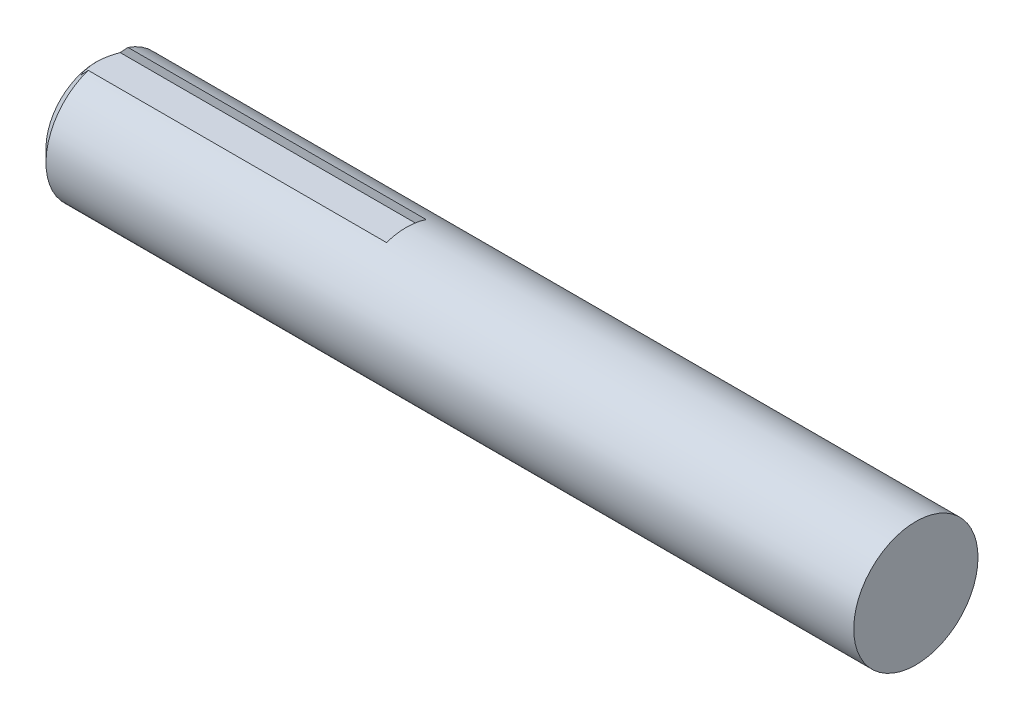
ISO-10303-21;
HEADER;
FILE_DESCRIPTION(('STEP AP214'),'2;1');
FILE_NAME('part.step','',(''),(''),'','','');
FILE_SCHEMA(('AUTOMOTIVE_DESIGN { 1 0 10303 214 1 1 1 1 }'));
ENDSEC;
DATA;
#1=APPLICATION_CONTEXT('core data for automotive mechanical design processes');
#2=APPLICATION_PROTOCOL_DEFINITION('international standard','automotive_design',2000,#1);
#3=PRODUCT_CONTEXT('',#1,'mechanical');
#4=PRODUCT('Part','Part','',(#3));
#5=PRODUCT_RELATED_PRODUCT_CATEGORY('part','',(#4));
#6=PRODUCT_DEFINITION_FORMATION('','',#4);
#7=PRODUCT_DEFINITION_CONTEXT('part definition',#1,'design');
#8=PRODUCT_DEFINITION('design','',#6,#7);
#9=PRODUCT_DEFINITION_SHAPE('','',#8);
#10=(LENGTH_UNIT() NAMED_UNIT(*) SI_UNIT(.MILLI.,.METRE.));
#11=(NAMED_UNIT(*) PLANE_ANGLE_UNIT() SI_UNIT($,.RADIAN.));
#12=(NAMED_UNIT(*) SI_UNIT($,.STERADIAN.) SOLID_ANGLE_UNIT());
#13=UNCERTAINTY_MEASURE_WITH_UNIT(LENGTH_MEASURE(1.E-05),#10,'distance_accuracy_value','');
#14=(GEOMETRIC_REPRESENTATION_CONTEXT(3) GLOBAL_UNCERTAINTY_ASSIGNED_CONTEXT((#13)) GLOBAL_UNIT_ASSIGNED_CONTEXT((#10,
#11,#12)) REPRESENTATION_CONTEXT('',''));
#15=CARTESIAN_POINT('',(0.,0.,0.));
#16=DIRECTION('',(0.,0.,1.));
#17=DIRECTION('',(1.,0.,0.));
#18=AXIS2_PLACEMENT_3D('',#15,#16,#17);
#19=CARTESIAN_POINT('',(330.,0.,0.));
#20=DIRECTION('',(-1.,0.,0.));
#21=DIRECTION('',(0.,0.,1.));
#22=AXIS2_PLACEMENT_3D('',#19,#20,#21);
#23=CYLINDRICAL_SURFACE('',#22,25.);
#24=CARTESIAN_POINT('',(330.,0.,0.));
#25=DIRECTION('',(1.,0.,0.));
#26=DIRECTION('',(0.,0.,-1.));
#27=AXIS2_PLACEMENT_3D('',#24,#25,#26);
#28=CIRCLE('',#27,25.);
#29=CARTESIAN_POINT('',(330.,0.,-25.));
#30=VERTEX_POINT('',#29);
#31=EDGE_CURVE('E112',#30,#30,#28,.T.);
#32=ORIENTED_EDGE('',*,*,#31,.F.);
#33=EDGE_LOOP('',(#32));
#34=FACE_BOUND('',#33,.T.);
#35=DIRECTION('',(-1.,0.,0.));
#36=VECTOR('',#35,1.);
#37=CARTESIAN_POINT('',(330.,23.685438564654,8.));
#38=LINE('',#37,#36);
#39=CARTESIAN_POINT('',(5.00000000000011,23.685438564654,8.));
#40=VERTEX_POINT('',#39);
#41=CARTESIAN_POINT('',(125.,23.685438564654,8.));
#42=VERTEX_POINT('',#41);
#43=EDGE_CURVE('E90',#40,#42,#38,.F.);
#44=ORIENTED_EDGE('',*,*,#43,.F.);
#45=CARTESIAN_POINT('',(5.00000000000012,0.,0.));
#46=DIRECTION('',(1.,0.,0.));
#47=DIRECTION('',(0.,0.,-1.));
#48=AXIS2_PLACEMENT_3D('',#45,#46,#47);
#49=CIRCLE('',#48,25.);
#50=CARTESIAN_POINT('',(5.00000000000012,23.685438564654,-8.));
#51=VERTEX_POINT('',#50);
#52=EDGE_CURVE('E115',#40,#51,#49,.T.);
#53=ORIENTED_EDGE('',*,*,#52,.T.);
#54=DIRECTION('',(-1.,0.,0.));
#55=VECTOR('',#54,1.);
#56=CARTESIAN_POINT('',(330.,23.685438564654,-8.));
#57=LINE('',#56,#55);
#58=CARTESIAN_POINT('',(125.,23.685438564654,-8.));
#59=VERTEX_POINT('',#58);
#60=EDGE_CURVE('E61',#51,#59,#57,.F.);
#61=ORIENTED_EDGE('',*,*,#60,.T.);
#62=CARTESIAN_POINT('',(125.,0.,0.));
#63=DIRECTION('',(1.,0.,0.));
#64=DIRECTION('',(0.,0.,-1.));
#65=AXIS2_PLACEMENT_3D('',#62,#63,#64);
#66=CIRCLE('',#65,25.);
#67=EDGE_CURVE('E13',#59,#42,#66,.T.);
#68=ORIENTED_EDGE('',*,*,#67,.T.);
#69=EDGE_LOOP('',(#44,#53,#61,#68));
#70=FACE_BOUND('',#69,.T.);
#71=ADVANCED_FACE('F45',(#34,#70),#23,.T.);
#72=CARTESIAN_POINT('',(5.00000000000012,0.,0.));
#73=DIRECTION('',(1.,0.,0.));
#74=DIRECTION('',(0.,0.,-1.));
#75=AXIS2_PLACEMENT_3D('',#72,#73,#74);
#76=CONICAL_SURFACE('',#75,25.,0.785398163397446);
#77=CARTESIAN_POINT('',(0.,0.,0.));
#78=DIRECTION('',(1.,0.,0.));
#79=DIRECTION('',(0.,0.,-1.));
#80=AXIS2_PLACEMENT_3D('',#77,#78,#79);
#81=CIRCLE('',#80,19.9999999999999);
#82=CARTESIAN_POINT('',(0.,0.,-19.9999999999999));
#83=VERTEX_POINT('',#82);
#84=EDGE_CURVE('E118',#83,#83,#81,.F.);
#85=ORIENTED_EDGE('',*,*,#84,.F.);
#86=EDGE_LOOP('',(#85));
#87=FACE_BOUND('',#86,.T.);
#88=ORIENTED_EDGE('',*,*,#52,.F.);
#89=CARTESIAN_POINT('',(10.7681122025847,29.7098759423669,8.));
#90=CARTESIAN_POINT('',(10.0433923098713,28.9592784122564,8.));
#91=CARTESIAN_POINT('',(9.31957055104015,28.2078098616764,8.));
#92=CARTESIAN_POINT('',(7.87437262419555,26.7025455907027,8.));
#93=CARTESIAN_POINT('',(7.15299642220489,25.9487499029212,8.));
#94=CARTESIAN_POINT('',(5.71354289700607,24.4384605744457,8.));
#95=CARTESIAN_POINT('',(4.9954646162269,23.6819678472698,8.));
#96=CARTESIAN_POINT('',(3.56333884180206,22.1651410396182,8.));
#97=CARTESIAN_POINT('',(2.84929144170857,21.4048068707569,8.));
#98=CARTESIAN_POINT('',(1.42637398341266,19.8787800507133,8.));
#99=CARTESIAN_POINT('',(0.71750590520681,19.11308554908,8.));
#100=CARTESIAN_POINT('',(-0.340052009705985,17.9593145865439,8.));
#101=CARTESIAN_POINT('',(-0.691605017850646,17.5738626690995,8.));
#102=CARTESIAN_POINT('',(-1.39240577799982,16.8008698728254,8.));
#103=CARTESIAN_POINT('',(-1.74165353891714,16.4133290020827,8.));
#104=CARTESIAN_POINT('',(-2.43747865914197,15.6356112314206,8.));
#105=CARTESIAN_POINT('',(-2.78405504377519,15.2454334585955,8.00000000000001));
#106=CARTESIAN_POINT('',(-3.47376251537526,14.4620550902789,8.00000000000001));
#107=CARTESIAN_POINT('',(-3.81689366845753,14.068854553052,8.00000000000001));
#108=CARTESIAN_POINT('',(-4.49893208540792,13.2786663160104,8.00000000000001));
#109=CARTESIAN_POINT('',(-4.83783852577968,12.8816779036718,8.00000000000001));
#110=CARTESIAN_POINT('',(-5.34210646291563,12.2827284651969,8.00000000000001));
#111=CARTESIAN_POINT('',(-5.50951933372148,12.0824941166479,8.00000000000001));
#112=CARTESIAN_POINT('',(-5.84278293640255,11.6807250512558,8.00000000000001));
#113=CARTESIAN_POINT('',(-6.0086336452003,11.4791903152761,8.00000000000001));
#114=CARTESIAN_POINT('',(-6.17360364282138,11.2769338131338,8.00000000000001));
#115=B_SPLINE_CURVE_WITH_KNOTS('',3,(#89,#90,#91,#92,#93,#94,#95,#96,#97,#98,#99,#100,#101,#102,
#103,#104,#105,#106,#107,#108,#109,#110,#111,#112,#113,#114),.UNSPECIFIED.,.F.,.F.,(4,2,2,2,2,2,
2,2,2,2,2,2,4),(0.,3.13010561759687,6.26016756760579,9.38925453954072,12.518413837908,
15.6487126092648,17.2137818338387,18.7788450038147,20.3444544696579,21.9100338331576,
23.4759137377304,24.2589058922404,25.0419095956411),.UNSPECIFIED.);
#116=CARTESIAN_POINT('',(1.81948670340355,20.3,8.));
#117=VERTEX_POINT('',#116);
#118=EDGE_CURVE('E54',#40,#117,#115,.T.);
#119=ORIENTED_EDGE('',*,*,#118,.T.);
#120=CARTESIAN_POINT('',(7.66095669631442,20.3,-18.7893194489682));
#121=CARTESIAN_POINT('',(7.49988087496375,20.3,-18.5521853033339));
#122=CARTESIAN_POINT('',(7.33992511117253,20.3,-18.3142911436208));
#123=CARTESIAN_POINT('',(7.02244350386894,20.3,-17.8368792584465));
#124=CARTESIAN_POINT('',(6.86491771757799,20.3,-17.5973614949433));
#125=CARTESIAN_POINT('',(6.39619336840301,20.3,-16.8760988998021));
#126=CARTESIAN_POINT('',(6.08893874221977,20.3,-16.3917781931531));
#127=CARTESIAN_POINT('',(5.48472973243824,20.3,-15.4120468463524));
#128=CARTESIAN_POINT('',(5.18786249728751,20.3,-14.9165823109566));
#129=CARTESIAN_POINT('',(4.60909380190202,20.3,-13.9170240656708));
#130=CARTESIAN_POINT('',(4.32719111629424,20.3,-13.4129310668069));
#131=CARTESIAN_POINT('',(3.77275130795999,20.3,-12.3794056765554));
#132=CARTESIAN_POINT('',(3.50077154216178,20.3,-11.8496713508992));
#133=CARTESIAN_POINT('',(2.97958683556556,20.3,-10.7791535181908));
#134=CARTESIAN_POINT('',(2.73038449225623,20.3,-10.2383687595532));
#135=CARTESIAN_POINT('',(2.02501240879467,20.3,-8.60110119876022));
#136=CARTESIAN_POINT('',(1.60911511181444,20.3,-7.48616813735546));
#137=CARTESIAN_POINT('',(1.11844678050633,20.3,-5.8422832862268));
#138=CARTESIAN_POINT('',(0.982421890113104,20.3,-5.33134687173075));
#139=CARTESIAN_POINT('',(0.744653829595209,20.3,-4.30134995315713));
#140=CARTESIAN_POINT('',(0.642915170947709,20.3,-3.78228838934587));
#141=CARTESIAN_POINT('',(0.478244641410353,20.3,-2.74379900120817));
#142=CARTESIAN_POINT('',(0.414902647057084,20.3,-2.22443658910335));
#143=CARTESIAN_POINT('',(0.327776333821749,20.3,-1.18230533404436));
#144=CARTESIAN_POINT('',(0.303992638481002,20.3,-0.659536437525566));
#145=CARTESIAN_POINT('',(0.298356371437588,20.3,0.174702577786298));
#146=CARTESIAN_POINT('',(0.303437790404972,20.3,0.486141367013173));
#147=CARTESIAN_POINT('',(0.327865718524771,20.3,1.10848235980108));
#148=CARTESIAN_POINT('',(0.34721269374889,20.3,1.41938454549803));
#149=CARTESIAN_POINT('',(0.3999043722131,20.3,2.04003002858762));
#150=CARTESIAN_POINT('',(0.433250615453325,20.3,2.34977319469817));
#151=CARTESIAN_POINT('',(0.513465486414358,20.3,2.96751554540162));
#152=CARTESIAN_POINT('',(0.560335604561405,20.3,3.27551453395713));
#153=CARTESIAN_POINT('',(0.721791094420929,20.3,4.20444345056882));
#154=CARTESIAN_POINT('',(0.856490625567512,20.3,4.82196368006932));
#155=CARTESIAN_POINT('',(1.17256634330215,20.3,6.04457347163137));
#156=CARTESIAN_POINT('',(1.35393580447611,20.3,6.64966481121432));
#157=CARTESIAN_POINT('',(1.77457945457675,20.3,7.9006429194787));
#158=CARTESIAN_POINT('',(2.0176119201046,20.3,8.54525659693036));
#159=CARTESIAN_POINT('',(2.54238669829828,20.3,9.81866120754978));
#160=CARTESIAN_POINT('',(2.82414569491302,20.3,10.4474451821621));
#161=CARTESIAN_POINT('',(3.41987572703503,20.3,11.6918754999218));
#162=CARTESIAN_POINT('',(3.7339451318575,20.3,12.3074743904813));
#163=CARTESIAN_POINT('',(4.38745449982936,20.3,13.5248523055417));
#164=CARTESIAN_POINT('',(4.72689081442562,20.3,14.1266333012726));
#165=CARTESIAN_POINT('',(5.41205083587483,20.3,15.2936635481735));
#166=CARTESIAN_POINT('',(5.75694889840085,20.3,15.8594000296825));
#167=CARTESIAN_POINT('',(6.462366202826,20.3,16.9810760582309));
#168=CARTESIAN_POINT('',(6.82288666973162,20.3,17.5370148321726));
#169=CARTESIAN_POINT('',(7.55396447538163,20.3,18.6359301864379));
#170=CARTESIAN_POINT('',(7.92442045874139,20.3,19.1789743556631));
#171=CARTESIAN_POINT('',(8.48803440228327,20.3,19.9878820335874));
#172=CARTESIAN_POINT('',(8.67720152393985,20.3,20.256539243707));
#173=CARTESIAN_POINT('',(9.05798122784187,20.3,20.7921066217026));
#174=CARTESIAN_POINT('',(9.24959375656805,20.3,21.0590168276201));
#175=CARTESIAN_POINT('',(9.44232652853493,20.3,21.3251164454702));
#176=B_SPLINE_CURVE_WITH_KNOTS('',3,(#120,#121,#122,#123,#124,#125,#126,#127,#128,#129,#130,
#131,#132,#133,#134,#135,#136,#137,#138,#139,#140,#141,#142,#143,#144,#145,#146,#147,#148,#149,
#150,#151,#152,#153,#154,#155,#156,#157,#158,#159,#160,#161,#162,#163,#164,#165,#166,#167,#168,
#169,#170,#171,#172,#173,#174,#175),.UNSPECIFIED.,.F.,.F.,(4,2,2,2,2,2,2,2,2,2,2,2,2,2,2,2,2,2,
2,2,2,2,2,2,2,2,2,4),(0.,0.859995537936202,1.7200112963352,3.44052711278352,5.17308551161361,
6.90550182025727,8.69137198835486,10.4774455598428,14.0374954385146,15.6227686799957,
17.2082504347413,18.7764843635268,20.3447430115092,21.2788923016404,22.2130721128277,
23.1473547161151,24.0817403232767,25.9755479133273,27.8690827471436,29.9342364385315,
32.0002826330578,34.0728163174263,36.1450524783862,38.1324929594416,40.1200895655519,
42.0920392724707,43.0777502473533,44.0634396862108),.UNSPECIFIED.);
#177=CARTESIAN_POINT('',(1.81948670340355,20.3,-8.));
#178=VERTEX_POINT('',#177);
#179=EDGE_CURVE('E100',#178,#117,#176,.T.);
#180=ORIENTED_EDGE('',*,*,#179,.F.);
#181=CARTESIAN_POINT('',(10.7681122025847,29.7098759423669,-8.));
#182=CARTESIAN_POINT('',(10.0433923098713,28.9592784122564,-8.));
#183=CARTESIAN_POINT('',(9.31957055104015,28.2078098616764,-8.));
#184=CARTESIAN_POINT('',(7.87437262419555,26.7025455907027,-8.));
#185=CARTESIAN_POINT('',(7.1529964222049,25.9487499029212,-8.));
#186=CARTESIAN_POINT('',(5.71354289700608,24.4384605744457,-8.));
#187=CARTESIAN_POINT('',(4.9954646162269,23.6819678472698,-8.));
#188=CARTESIAN_POINT('',(3.56333884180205,22.1651410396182,-8.));
#189=CARTESIAN_POINT('',(2.84929144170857,21.4048068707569,-8.));
#190=CARTESIAN_POINT('',(1.42637398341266,19.8787800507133,-8.));
#191=CARTESIAN_POINT('',(0.717505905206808,19.11308554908,-8.));
#192=CARTESIAN_POINT('',(-0.340052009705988,17.9593145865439,-8.));
#193=CARTESIAN_POINT('',(-0.69160501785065,17.5738626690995,-8.));
#194=CARTESIAN_POINT('',(-1.39240577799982,16.8008698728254,-8.));
#195=CARTESIAN_POINT('',(-1.74165353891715,16.4133290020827,-8.));
#196=CARTESIAN_POINT('',(-2.43747865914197,15.6356112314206,-8.));
#197=CARTESIAN_POINT('',(-2.78405504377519,15.2454334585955,-7.99999999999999));
#198=CARTESIAN_POINT('',(-3.47376251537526,14.4620550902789,-7.99999999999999));
#199=CARTESIAN_POINT('',(-3.81689366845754,14.068854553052,-7.99999999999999));
#200=CARTESIAN_POINT('',(-4.49893208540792,13.2786663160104,-7.99999999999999));
#201=CARTESIAN_POINT('',(-4.83783852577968,12.8816779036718,-7.99999999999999));
#202=CARTESIAN_POINT('',(-5.34210646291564,12.2827284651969,-7.99999999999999));
#203=CARTESIAN_POINT('',(-5.50951933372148,12.0824941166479,-7.99999999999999));
#204=CARTESIAN_POINT('',(-5.84278293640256,11.6807250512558,-7.99999999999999));
#205=CARTESIAN_POINT('',(-6.0086336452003,11.4791903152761,-7.99999999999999));
#206=CARTESIAN_POINT('',(-6.17360364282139,11.2769338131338,-7.99999999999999));
#207=B_SPLINE_CURVE_WITH_KNOTS('',3,(#181,#182,#183,#184,#185,#186,#187,#188,#189,#190,#191,
#192,#193,#194,#195,#196,#197,#198,#199,#200,#201,#202,#203,#204,#205,#206),.UNSPECIFIED.,.F.,
.F.,(4,2,2,2,2,2,2,2,2,2,2,2,4),(0.,3.13010561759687,6.26016756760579,9.38925453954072,
12.518413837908,15.6487126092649,17.2137818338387,18.7788450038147,20.3444544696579,
21.9100338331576,23.4759137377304,24.2589058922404,25.0419095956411),.UNSPECIFIED.);
#208=EDGE_CURVE('E121',#51,#178,#207,.T.);
#209=ORIENTED_EDGE('',*,*,#208,.F.);
#210=EDGE_LOOP('',(#88,#119,#180,#209));
#211=FACE_BOUND('',#210,.T.);
#212=ADVANCED_FACE('F47',(#87,#211),#76,.T.);
#213=CARTESIAN_POINT('',(330.,0.,0.));
#214=DIRECTION('',(1.,0.,0.));
#215=DIRECTION('',(0.,0.,-1.));
#216=AXIS2_PLACEMENT_3D('',#213,#214,#215);
#217=PLANE('',#216);
#218=ORIENTED_EDGE('',*,*,#31,.T.);
#219=EDGE_LOOP('',(#218));
#220=FACE_BOUND('',#219,.T.);
#221=ADVANCED_FACE('F141',(#220),#217,.T.);
#222=CARTESIAN_POINT('',(0.,0.,0.));
#223=DIRECTION('',(1.,0.,0.));
#224=DIRECTION('',(0.,0.,-1.));
#225=AXIS2_PLACEMENT_3D('',#222,#223,#224);
#226=PLANE('',#225);
#227=ORIENTED_EDGE('',*,*,#84,.T.);
#228=EDGE_LOOP('',(#227));
#229=FACE_BOUND('',#228,.T.);
#230=ADVANCED_FACE('F156',(#229),#226,.F.);
#231=CARTESIAN_POINT('',(125.,0.,0.));
#232=DIRECTION('',(1.,0.,0.));
#233=DIRECTION('',(0.,0.,-1.));
#234=AXIS2_PLACEMENT_3D('',#231,#232,#233);
#235=PLANE('',#234);
#236=DIRECTION('',(0.,-1.,0.));
#237=VECTOR('',#236,1.);
#238=CARTESIAN_POINT('',(125.,29.3,-8.));
#239=LINE('',#238,#237);
#240=CARTESIAN_POINT('',(125.,20.3,-8.));
#241=VERTEX_POINT('',#240);
#242=EDGE_CURVE('E104',#59,#241,#239,.T.);
#243=ORIENTED_EDGE('',*,*,#242,.T.);
#244=DIRECTION('',(0.,0.,1.));
#245=VECTOR('',#244,1.);
#246=CARTESIAN_POINT('',(125.,20.3,-8.));
#247=LINE('',#246,#245);
#248=CARTESIAN_POINT('',(125.,20.3,8.));
#249=VERTEX_POINT('',#248);
#250=EDGE_CURVE('E93',#241,#249,#247,.T.);
#251=ORIENTED_EDGE('',*,*,#250,.T.);
#252=DIRECTION('',(0.,-1.,0.));
#253=VECTOR('',#252,1.);
#254=CARTESIAN_POINT('',(125.,29.3,8.));
#255=LINE('',#254,#253);
#256=EDGE_CURVE('E86',#42,#249,#255,.T.);
#257=ORIENTED_EDGE('',*,*,#256,.F.);
#258=ORIENTED_EDGE('',*,*,#67,.F.);
#259=EDGE_LOOP('',(#243,#251,#257,#258));
#260=FACE_BOUND('',#259,.T.);
#261=ADVANCED_FACE('F103',(#260),#235,.F.);
#262=CARTESIAN_POINT('',(125.,29.3,8.));
#263=DIRECTION('',(0.,0.,-1.));
#264=DIRECTION('',(0.,1.,0.));
#265=AXIS2_PLACEMENT_3D('',#262,#263,#264);
#266=PLANE('',#265);
#267=ORIENTED_EDGE('',*,*,#43,.T.);
#268=ORIENTED_EDGE('',*,*,#256,.T.);
#269=DIRECTION('',(-1.,0.,0.));
#270=VECTOR('',#269,1.);
#271=CARTESIAN_POINT('',(125.,20.3,8.));
#272=LINE('',#271,#270);
#273=EDGE_CURVE('E89',#249,#117,#272,.T.);
#274=ORIENTED_EDGE('',*,*,#273,.T.);
#275=ORIENTED_EDGE('',*,*,#118,.F.);
#276=EDGE_LOOP('',(#267,#268,#274,#275));
#277=FACE_BOUND('',#276,.T.);
#278=ADVANCED_FACE('F88',(#277),#266,.T.);
#279=CARTESIAN_POINT('',(125.,29.3,-8.));
#280=DIRECTION('',(0.,0.,-1.));
#281=DIRECTION('',(0.,1.,0.));
#282=AXIS2_PLACEMENT_3D('',#279,#280,#281);
#283=PLANE('',#282);
#284=ORIENTED_EDGE('',*,*,#208,.T.);
#285=DIRECTION('',(-1.,0.,0.));
#286=VECTOR('',#285,1.);
#287=CARTESIAN_POINT('',(125.,20.3,-8.));
#288=LINE('',#287,#286);
#289=EDGE_CURVE('E101',#241,#178,#288,.T.);
#290=ORIENTED_EDGE('',*,*,#289,.F.);
#291=ORIENTED_EDGE('',*,*,#242,.F.);
#292=ORIENTED_EDGE('',*,*,#60,.F.);
#293=EDGE_LOOP('',(#284,#290,#291,#292));
#294=FACE_BOUND('',#293,.T.);
#295=ADVANCED_FACE('F131',(#294),#283,.F.);
#296=CARTESIAN_POINT('',(125.,20.3,-8.));
#297=DIRECTION('',(0.,-1.,0.));
#298=DIRECTION('',(0.,0.,-1.));
#299=AXIS2_PLACEMENT_3D('',#296,#297,#298);
#300=PLANE('',#299);
#301=ORIENTED_EDGE('',*,*,#179,.T.);
#302=ORIENTED_EDGE('',*,*,#273,.F.);
#303=ORIENTED_EDGE('',*,*,#250,.F.);
#304=ORIENTED_EDGE('',*,*,#289,.T.);
#305=EDGE_LOOP('',(#301,#302,#303,#304));
#306=FACE_BOUND('',#305,.T.);
#307=ADVANCED_FACE('F97',(#306),#300,.F.);
#308=CLOSED_SHELL('',(#71,#212,#221,#230,#261,#278,#295,#307));
#309=MANIFOLD_SOLID_BREP('B2',#308);
#310=ADVANCED_BREP_SHAPE_REPRESENTATION('',(#18,#309),#14);
#311=SHAPE_DEFINITION_REPRESENTATION(#9,#310);
ENDSEC;
END-ISO-10303-21;
